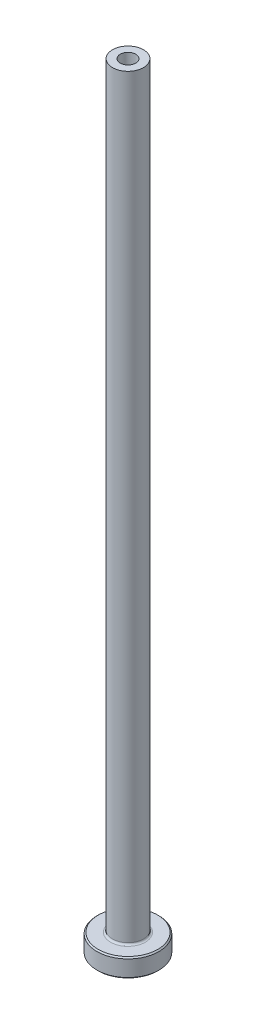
from build123d import *

# Parameters (mm, degrees)
FILLET1_R     = 0.3
CHAMFER1_SIZE = 0.2
CHAMFER3_SIZE = 0.5


with BuildPart() as part:
    # Sketch1 → Revolve1 (revolve)
    with BuildSketch(Plane.XY, mode=Mode.PRIVATE) as revolve1_sk:
        Polygon((-1.25, 125), (-2.5, 125), (-2.5, 3), (-5, 3), (-5, 0), (-1.5, 0), (-1.5, 78), (-1.25, 90), align=None)
    revolve(revolve1_sk.sketch.rotate(Axis((0, 92.187680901, 0), (0, -1, 0)), 270), axis=Axis((0, 92.187680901, 0), (0, -1, 0)))

    # Fillet1
    fillet1_edges = [part.edges().sort_by_distance(p)[0] for p in [
        (0, 3, -2.5),
    ]]
    fillet(fillet1_edges, radius=FILLET1_R)

    # Chamfer1
    chamfer1_edges = [part.edges().sort_by_distance(p)[0] for p in [
        (0, 0, -5),
        (0, 3, -5),
    ]]
    chamfer(chamfer1_edges, length=CHAMFER1_SIZE)

    # Chamfer3
    chamfer3_edges = [part.edges().sort_by_distance(p)[0] for p in [
        (0, 0, -1.5),
    ]]
    chamfer(chamfer3_edges, length=CHAMFER3_SIZE)


solid = part.part
